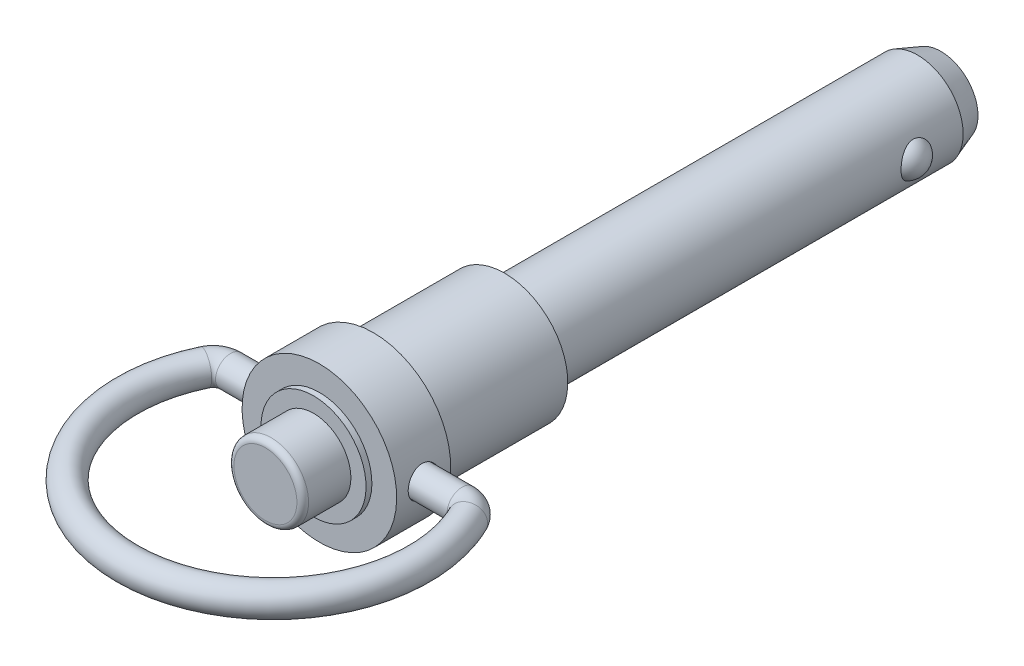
ISO-10303-21;
HEADER;
FILE_DESCRIPTION(('STEP AP214'),'2;1');
FILE_NAME('part.step','',(''),(''),'','','');
FILE_SCHEMA(('AUTOMOTIVE_DESIGN { 1 0 10303 214 1 1 1 1 }'));
ENDSEC;
DATA;
#1=APPLICATION_CONTEXT('core data for automotive mechanical design processes');
#2=APPLICATION_PROTOCOL_DEFINITION('international standard','automotive_design',2000,#1);
#3=PRODUCT_CONTEXT('',#1,'mechanical');
#4=PRODUCT('Part','Part','',(#3));
#5=PRODUCT_RELATED_PRODUCT_CATEGORY('part','',(#4));
#6=PRODUCT_DEFINITION_FORMATION('','',#4);
#7=PRODUCT_DEFINITION_CONTEXT('part definition',#1,'design');
#8=PRODUCT_DEFINITION('design','',#6,#7);
#9=PRODUCT_DEFINITION_SHAPE('','',#8);
#10=(LENGTH_UNIT() NAMED_UNIT(*) SI_UNIT(.MILLI.,.METRE.));
#11=(NAMED_UNIT(*) PLANE_ANGLE_UNIT() SI_UNIT($,.RADIAN.));
#12=(NAMED_UNIT(*) SI_UNIT($,.STERADIAN.) SOLID_ANGLE_UNIT());
#13=UNCERTAINTY_MEASURE_WITH_UNIT(LENGTH_MEASURE(1.E-05),#10,'distance_accuracy_value','');
#14=(GEOMETRIC_REPRESENTATION_CONTEXT(3) GLOBAL_UNCERTAINTY_ASSIGNED_CONTEXT((#13)) GLOBAL_UNIT_ASSIGNED_CONTEXT((#10,
#11,#12)) REPRESENTATION_CONTEXT('',''));
#15=CARTESIAN_POINT('',(0.,0.,0.));
#16=DIRECTION('',(0.,0.,1.));
#17=DIRECTION('',(1.,0.,0.));
#18=AXIS2_PLACEMENT_3D('',#15,#16,#17);
#19=CARTESIAN_POINT('',(5.7785,0.,11.43));
#20=DIRECTION('',(0.,0.,-1.));
#21=DIRECTION('',(0.,1.,0.));
#22=AXIS2_PLACEMENT_3D('',#19,#20,#21);
#23=PLANE('',#22);
#24=CARTESIAN_POINT('',(0.,0.,11.43));
#25=DIRECTION('',(0.,0.,-1.));
#26=DIRECTION('',(0.,1.,0.));
#27=AXIS2_PLACEMENT_3D('',#24,#25,#26);
#28=CIRCLE('',#27,5.9);
#29=CARTESIAN_POINT('',(0.,5.9,11.43));
#30=VERTEX_POINT('',#29);
#31=EDGE_CURVE('E22',#30,#30,#28,.F.);
#32=ORIENTED_EDGE('',*,*,#31,.T.);
#33=EDGE_LOOP('',(#32));
#34=FACE_BOUND('',#33,.T.);
#35=CARTESIAN_POINT('',(0.,0.,11.43));
#36=DIRECTION('',(0.,0.,-1.));
#37=DIRECTION('',(0.,1.,0.));
#38=AXIS2_PLACEMENT_3D('',#35,#36,#37);
#39=CIRCLE('',#38,6.731);
#40=CARTESIAN_POINT('',(0.,6.731,11.43));
#41=VERTEX_POINT('',#40);
#42=EDGE_CURVE('E119',#41,#41,#39,.T.);
#43=ORIENTED_EDGE('',*,*,#42,.T.);
#44=EDGE_LOOP('',(#43));
#45=FACE_BOUND('',#44,.T.);
#46=ADVANCED_FACE('F14',(#34,#45),#23,.T.);
#47=CARTESIAN_POINT('',(0.,0.,20.828));
#48=DIRECTION('',(0.,0.,1.));
#49=DIRECTION('',(0.,-1.,0.));
#50=AXIS2_PLACEMENT_3D('',#47,#48,#49);
#51=PLANE('',#50);
#52=CARTESIAN_POINT('',(0.,0.,20.828));
#53=DIRECTION('',(0.,0.,-1.));
#54=DIRECTION('',(0.,1.,0.));
#55=AXIS2_PLACEMENT_3D('',#52,#53,#54);
#56=CIRCLE('',#55,2.7432);
#57=CARTESIAN_POINT('',(0.,2.7432,20.828));
#58=VERTEX_POINT('',#57);
#59=CARTESIAN_POINT('',(0.,-2.7432,20.828));
#60=VERTEX_POINT('',#59);
#61=EDGE_CURVE('E35',#58,#60,#56,.T.);
#62=ORIENTED_EDGE('',*,*,#61,.F.);
#63=CARTESIAN_POINT('',(0.,0.,20.828));
#64=DIRECTION('',(0.,0.,-1.));
#65=DIRECTION('',(0.,-1.,0.));
#66=AXIS2_PLACEMENT_3D('',#63,#64,#65);
#67=CIRCLE('',#66,2.7432);
#68=EDGE_CURVE('E28',#60,#58,#67,.T.);
#69=ORIENTED_EDGE('',*,*,#68,.F.);
#70=EDGE_LOOP('',(#62,#69));
#71=FACE_BOUND('',#70,.T.);
#72=ADVANCED_FACE('F41',(#71),#51,.T.);
#73=CARTESIAN_POINT('',(0.,0.,20.1422));
#74=DIRECTION('',(0.,1.,0.));
#75=DIRECTION('',(-1.,0.,0.));
#76=AXIS2_PLACEMENT_3D('',#73,#74,#75);
#77=TOROIDAL_SURFACE('',#76,12.7,1.2954);
#78=CARTESIAN_POINT('',(-11.4549005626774,0.,14.6581090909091));
#79=DIRECTION('',(-0.43181818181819,0.,0.901960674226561));
#80=DIRECTION('',(-0.901960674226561,0.,-0.43181818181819));
#81=AXIS2_PLACEMENT_3D('',#78,#79,#80);
#82=CIRCLE('',#81,1.2954);
#83=CARTESIAN_POINT('',(-12.6233004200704,0.,14.0987318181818));
#84=VERTEX_POINT('',#83);
#85=EDGE_CURVE('E108',#84,#84,#82,.F.);
#86=ORIENTED_EDGE('',*,*,#85,.F.);
#87=EDGE_LOOP('',(#86));
#88=FACE_BOUND('',#87,.T.);
#89=CARTESIAN_POINT('',(11.4549005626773,0.,14.658109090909));
#90=DIRECTION('',(-0.431818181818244,0.,-0.901960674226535));
#91=DIRECTION('',(0.901960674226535,0.,-0.431818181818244));
#92=AXIS2_PLACEMENT_3D('',#89,#90,#91);
#93=CIRCLE('',#92,1.2954);
#94=CARTESIAN_POINT('',(12.6233004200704,0.,14.0987318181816));
#95=VERTEX_POINT('',#94);
#96=EDGE_CURVE('E42',#95,#95,#93,.T.);
#97=ORIENTED_EDGE('',*,*,#96,.F.);
#98=EDGE_LOOP('',(#97));
#99=FACE_BOUND('',#98,.T.);
#100=ADVANCED_FACE('F60',(#88,#99),#77,.T.);
#101=CARTESIAN_POINT('',(0.,0.,20.32));
#102=DIRECTION('',(0.,0.,1.));
#103=DIRECTION('',(0.,-1.,0.));
#104=AXIS2_PLACEMENT_3D('',#101,#102,#103);
#105=TOROIDAL_SURFACE('',#104,2.7432,0.508);
#106=ORIENTED_EDGE('',*,*,#68,.T.);
#107=ORIENTED_EDGE('',*,*,#61,.T.);
#108=EDGE_LOOP('',(#106,#107));
#109=FACE_BOUND('',#108,.T.);
#110=CARTESIAN_POINT('',(0.,0.,20.32));
#111=DIRECTION('',(0.,0.,-1.));
#112=DIRECTION('',(0.,1.,0.));
#113=AXIS2_PLACEMENT_3D('',#110,#111,#112);
#114=CIRCLE('',#113,3.2512);
#115=CARTESIAN_POINT('',(0.,3.2512,20.32));
#116=VERTEX_POINT('',#115);
#117=EDGE_CURVE('E111',#116,#116,#114,.T.);
#118=ORIENTED_EDGE('',*,*,#117,.F.);
#119=EDGE_LOOP('',(#118));
#120=FACE_BOUND('',#119,.T.);
#121=ADVANCED_FACE('F33',(#109,#120),#105,.T.);
#122=CARTESIAN_POINT('',(10.0803124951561,0.,15.3162));
#123=DIRECTION('',(0.,1.,0.));
#124=DIRECTION('',(-1.,0.,0.));
#125=AXIS2_PLACEMENT_3D('',#122,#123,#124);
#126=TOROIDAL_SURFACE('',#125,1.524,1.2954);
#127=ORIENTED_EDGE('',*,*,#96,.T.);
#128=EDGE_LOOP('',(#127));
#129=FACE_BOUND('',#128,.T.);
#130=CARTESIAN_POINT('',(10.0803124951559,0.,13.7922));
#131=DIRECTION('',(1.,0.,0.));
#132=DIRECTION('',(0.,1.,0.));
#133=AXIS2_PLACEMENT_3D('',#130,#131,#132);
#134=CIRCLE('',#133,1.2954);
#135=CARTESIAN_POINT('',(10.0803124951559,1.2954,13.7922));
#136=VERTEX_POINT('',#135);
#137=EDGE_CURVE('E105',#136,#136,#134,.F.);
#138=ORIENTED_EDGE('',*,*,#137,.F.);
#139=EDGE_LOOP('',(#138));
#140=FACE_BOUND('',#139,.T.);
#141=ADVANCED_FACE('F84',(#129,#140),#126,.T.);
#142=CARTESIAN_POINT('',(-10.0803124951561,0.,15.3162));
#143=DIRECTION('',(0.,1.,0.));
#144=DIRECTION('',(-1.,0.,0.));
#145=AXIS2_PLACEMENT_3D('',#142,#143,#144);
#146=TOROIDAL_SURFACE('',#145,1.524,1.2954);
#147=CARTESIAN_POINT('',(-10.0803124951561,0.,13.7922));
#148=DIRECTION('',(1.,0.,0.));
#149=DIRECTION('',(0.,1.,0.));
#150=AXIS2_PLACEMENT_3D('',#147,#148,#149);
#151=CIRCLE('',#150,1.2954);
#152=CARTESIAN_POINT('',(-10.0803124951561,1.2954,13.7922));
#153=VERTEX_POINT('',#152);
#154=EDGE_CURVE('E100',#153,#153,#151,.T.);
#155=ORIENTED_EDGE('',*,*,#154,.F.);
#156=EDGE_LOOP('',(#155));
#157=FACE_BOUND('',#156,.T.);
#158=ORIENTED_EDGE('',*,*,#85,.T.);
#159=EDGE_LOOP('',(#158));
#160=FACE_BOUND('',#159,.T.);
#161=ADVANCED_FACE('F87',(#157,#160),#146,.T.);
#162=CARTESIAN_POINT('',(0.,0.,20.828));
#163=DIRECTION('',(0.,0.,-1.));
#164=DIRECTION('',(0.,1.,0.));
#165=AXIS2_PLACEMENT_3D('',#162,#163,#164);
#166=CYLINDRICAL_SURFACE('',#165,3.2512);
#167=CARTESIAN_POINT('',(0.,0.,16.637));
#168=DIRECTION('',(0.,0.,-1.));
#169=DIRECTION('',(0.,1.,0.));
#170=AXIS2_PLACEMENT_3D('',#167,#168,#169);
#171=CIRCLE('',#170,3.2512);
#172=CARTESIAN_POINT('',(0.,3.2512,16.637));
#173=VERTEX_POINT('',#172);
#174=EDGE_CURVE('E104',#173,#173,#171,.T.);
#175=ORIENTED_EDGE('',*,*,#174,.F.);
#176=EDGE_LOOP('',(#175));
#177=FACE_BOUND('',#176,.T.);
#178=ORIENTED_EDGE('',*,*,#117,.T.);
#179=EDGE_LOOP('',(#178));
#180=FACE_BOUND('',#179,.T.);
#181=ADVANCED_FACE('F89',(#177,#180),#166,.T.);
#182=CARTESIAN_POINT('',(-10.0803124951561,0.,13.7922));
#183=DIRECTION('',(1.,0.,0.));
#184=DIRECTION('',(0.,1.,0.));
#185=AXIS2_PLACEMENT_3D('',#182,#183,#184);
#186=CYLINDRICAL_SURFACE('',#185,1.2954);
#187=CARTESIAN_POINT('',(4.953,0.,13.7922));
#188=DIRECTION('',(1.,0.,0.));
#189=DIRECTION('',(0.,1.,0.));
#190=AXIS2_PLACEMENT_3D('',#187,#188,#189);
#191=CIRCLE('',#190,1.2954);
#192=CARTESIAN_POINT('',(4.953,1.2954,13.7922));
#193=VERTEX_POINT('',#192);
#194=EDGE_CURVE('E103',#193,#193,#191,.F.);
#195=ORIENTED_EDGE('',*,*,#194,.F.);
#196=EDGE_LOOP('',(#195));
#197=FACE_BOUND('',#196,.T.);
#198=ORIENTED_EDGE('',*,*,#137,.T.);
#199=EDGE_LOOP('',(#198));
#200=FACE_BOUND('',#199,.T.);
#201=ADVANCED_FACE('F92',(#197,#200),#186,.T.);
#202=CARTESIAN_POINT('',(-10.0803124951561,0.,13.7922));
#203=DIRECTION('',(1.,0.,0.));
#204=DIRECTION('',(0.,1.,0.));
#205=AXIS2_PLACEMENT_3D('',#202,#203,#204);
#206=CYLINDRICAL_SURFACE('',#205,1.2954);
#207=CARTESIAN_POINT('',(-4.953,0.,13.7922));
#208=DIRECTION('',(1.,0.,0.));
#209=DIRECTION('',(0.,1.,0.));
#210=AXIS2_PLACEMENT_3D('',#207,#208,#209);
#211=CIRCLE('',#210,1.2954);
#212=CARTESIAN_POINT('',(-4.953,1.2954,13.7922));
#213=VERTEX_POINT('',#212);
#214=EDGE_CURVE('E192',#213,#213,#211,.T.);
#215=ORIENTED_EDGE('',*,*,#214,.F.);
#216=EDGE_LOOP('',(#215));
#217=FACE_BOUND('',#216,.T.);
#218=ORIENTED_EDGE('',*,*,#154,.T.);
#219=EDGE_LOOP('',(#218));
#220=FACE_BOUND('',#219,.T.);
#221=ADVANCED_FACE('F238',(#217,#220),#206,.T.);
#222=CARTESIAN_POINT('',(4.572,0.,16.637));
#223=DIRECTION('',(0.,0.,1.));
#224=DIRECTION('',(0.,-1.,0.));
#225=AXIS2_PLACEMENT_3D('',#222,#223,#224);
#226=PLANE('',#225);
#227=ORIENTED_EDGE('',*,*,#174,.T.);
#228=EDGE_LOOP('',(#227));
#229=FACE_BOUND('',#228,.T.);
#230=CARTESIAN_POINT('',(0.,0.,16.637));
#231=DIRECTION('',(0.,0.,-1.));
#232=DIRECTION('',(0.,1.,0.));
#233=AXIS2_PLACEMENT_3D('',#230,#231,#232);
#234=CIRCLE('',#233,4.572);
#235=CARTESIAN_POINT('',(0.,4.572,16.637));
#236=VERTEX_POINT('',#235);
#237=EDGE_CURVE('E196',#236,#236,#234,.T.);
#238=ORIENTED_EDGE('',*,*,#237,.F.);
#239=EDGE_LOOP('',(#238));
#240=FACE_BOUND('',#239,.T.);
#241=ADVANCED_FACE('F205',(#229,#240),#226,.T.);
#242=CARTESIAN_POINT('',(4.953,0.,13.7922));
#243=DIRECTION('',(1.,0.,0.));
#244=DIRECTION('',(0.,1.,0.));
#245=AXIS2_PLACEMENT_3D('',#242,#243,#244);
#246=PLANE('',#245);
#247=CARTESIAN_POINT('',(4.953,0.,13.7922));
#248=DIRECTION('',(1.,0.,0.));
#249=DIRECTION('',(0.,1.,0.));
#250=AXIS2_PLACEMENT_3D('',#247,#248,#249);
#251=CIRCLE('',#250,1.3335);
#252=CARTESIAN_POINT('',(4.953,1.3335,13.7922));
#253=VERTEX_POINT('',#252);
#254=EDGE_CURVE('E189',#253,#253,#251,.T.);
#255=ORIENTED_EDGE('',*,*,#254,.T.);
#256=EDGE_LOOP('',(#255));
#257=FACE_BOUND('',#256,.T.);
#258=ORIENTED_EDGE('',*,*,#194,.T.);
#259=EDGE_LOOP('',(#258));
#260=FACE_BOUND('',#259,.T.);
#261=ADVANCED_FACE('F248',(#257,#260),#246,.T.);
#262=CARTESIAN_POINT('',(-4.953,0.,13.7922));
#263=DIRECTION('',(-1.,0.,0.));
#264=DIRECTION('',(0.,-1.,0.));
#265=AXIS2_PLACEMENT_3D('',#262,#263,#264);
#266=PLANE('',#265);
#267=CARTESIAN_POINT('',(-4.953,0.,13.7922));
#268=DIRECTION('',(-1.,0.,0.));
#269=DIRECTION('',(0.,-1.,0.));
#270=AXIS2_PLACEMENT_3D('',#267,#268,#269);
#271=CIRCLE('',#270,1.3335);
#272=CARTESIAN_POINT('',(-4.95299999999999,-1.33350000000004,13.7922));
#273=VERTEX_POINT('',#272);
#274=EDGE_CURVE('E156',#273,#273,#271,.T.);
#275=ORIENTED_EDGE('',*,*,#274,.T.);
#276=EDGE_LOOP('',(#275));
#277=FACE_BOUND('',#276,.T.);
#278=ORIENTED_EDGE('',*,*,#214,.T.);
#279=EDGE_LOOP('',(#278));
#280=FACE_BOUND('',#279,.T.);
#281=ADVANCED_FACE('F164',(#277,#280),#266,.T.);
#282=CARTESIAN_POINT('',(0.,0.,0.));
#283=DIRECTION('',(0.,0.,-1.));
#284=DIRECTION('',(0.,1.,0.));
#285=AXIS2_PLACEMENT_3D('',#282,#283,#284);
#286=CYLINDRICAL_SURFACE('',#285,4.572);
#287=ORIENTED_EDGE('',*,*,#237,.T.);
#288=EDGE_LOOP('',(#287));
#289=FACE_BOUND('',#288,.T.);
#290=CARTESIAN_POINT('',(0.,0.,16.129));
#291=DIRECTION('',(0.,0.,-1.));
#292=DIRECTION('',(0.,1.,0.));
#293=AXIS2_PLACEMENT_3D('',#290,#291,#292);
#294=CIRCLE('',#293,4.572);
#295=CARTESIAN_POINT('',(0.,4.572,16.129));
#296=VERTEX_POINT('',#295);
#297=EDGE_CURVE('E191',#296,#296,#294,.T.);
#298=ORIENTED_EDGE('',*,*,#297,.F.);
#299=EDGE_LOOP('',(#298));
#300=FACE_BOUND('',#299,.T.);
#301=ADVANCED_FACE('F162',(#289,#300),#286,.T.);
#302=CARTESIAN_POINT('',(4.953,0.,13.7922));
#303=DIRECTION('',(1.,0.,0.));
#304=DIRECTION('',(0.,1.,0.));
#305=AXIS2_PLACEMENT_3D('',#302,#303,#304);
#306=CYLINDRICAL_SURFACE('',#305,1.3335);
#307=CARTESIAN_POINT('',(6.59758582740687,1.3335,13.7922));
#308=CARTESIAN_POINT('',(6.59758765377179,1.333496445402,13.718166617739));
#309=CARTESIAN_POINT('',(6.59884669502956,1.3273080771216,13.6440410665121));
#310=CARTESIAN_POINT('',(6.60374356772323,1.30272126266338,13.4978267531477));
#311=CARTESIAN_POINT('',(6.60738612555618,1.28429855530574,13.4257423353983));
#312=CARTESIAN_POINT('',(6.61662138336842,1.23583426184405,13.28583488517));
#313=CARTESIAN_POINT('',(6.622211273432,1.20580941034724,13.2180058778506));
#314=CARTESIAN_POINT('',(6.63470762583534,1.13503345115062,13.0883707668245));
#315=CARTESIAN_POINT('',(6.64161365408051,1.09428587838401,13.0265626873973));
#316=CARTESIAN_POINT('',(6.6560731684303,1.00260929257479,12.9098323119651));
#317=CARTESIAN_POINT('',(6.66363369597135,0.951558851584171,12.8550062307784));
#318=CARTESIAN_POINT('',(6.6784886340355,0.840985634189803,12.7546347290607));
#319=CARTESIAN_POINT('',(6.68578301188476,0.781461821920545,12.7090904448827));
#320=CARTESIAN_POINT('',(6.69935837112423,0.655004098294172,12.6282103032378));
#321=CARTESIAN_POINT('',(6.70563018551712,0.588011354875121,12.5929647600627));
#322=CARTESIAN_POINT('',(6.7163755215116,0.448910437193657,12.5342656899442));
#323=CARTESIAN_POINT('',(6.72084922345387,0.376802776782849,12.5108109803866));
#324=CARTESIAN_POINT('',(6.72744504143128,0.230507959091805,12.4766555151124));
#325=CARTESIAN_POINT('',(6.72959681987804,0.156359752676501,12.4657937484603));
#326=CARTESIAN_POINT('',(6.73140875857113,0.00726425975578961,12.4566302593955));
#327=CARTESIAN_POINT('',(6.73106915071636,-0.0676829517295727,12.4583273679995));
#328=CARTESIAN_POINT('',(6.72795960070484,-0.215142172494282,12.4741110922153));
#329=CARTESIAN_POINT('',(6.72522369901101,-0.287673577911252,12.4880241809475));
#330=CARTESIAN_POINT('',(6.71766729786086,-0.429351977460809,12.5275699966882));
#331=CARTESIAN_POINT('',(6.71284670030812,-0.498498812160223,12.5532032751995));
#332=CARTESIAN_POINT('',(6.701606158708,-0.631943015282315,12.6156242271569));
#333=CARTESIAN_POINT('',(6.69517643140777,-0.696207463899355,12.6524804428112));
#334=CARTESIAN_POINT('',(6.68142742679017,-0.817699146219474,12.7362475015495));
#335=CARTESIAN_POINT('',(6.67410811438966,-0.874926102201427,12.7831587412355));
#336=CARTESIAN_POINT('',(6.65924190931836,-0.981743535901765,12.8866477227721));
#337=CARTESIAN_POINT('',(6.65169326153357,-1.03118836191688,12.9433756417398));
#338=CARTESIAN_POINT('',(6.63733339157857,-1.11990778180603,13.06442219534));
#339=CARTESIAN_POINT('',(6.63052249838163,-1.1591778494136,13.1287441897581));
#340=CARTESIAN_POINT('',(6.61840508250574,-1.22647971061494,13.2633777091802));
#341=CARTESIAN_POINT('',(6.61310290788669,-1.25447911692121,13.3337058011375));
#342=CARTESIAN_POINT('',(6.60466715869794,-1.29816626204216,13.4781072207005));
#343=CARTESIAN_POINT('',(6.6015290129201,-1.31387996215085,13.5521722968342));
#344=CARTESIAN_POINT('',(6.59896792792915,-1.32664627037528,13.6543666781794));
#345=CARTESIAN_POINT('',(6.59845085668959,-1.3292142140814,13.6818643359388));
#346=CARTESIAN_POINT('',(6.59775946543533,-1.33264174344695,13.7369703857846));
#347=CARTESIAN_POINT('',(6.59758514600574,-1.33350132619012,13.7645787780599));
#348=CARTESIAN_POINT('',(6.59758765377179,-1.333496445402,13.866233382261));
#349=CARTESIAN_POINT('',(6.59884669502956,-1.3273080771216,13.9403589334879));
#350=CARTESIAN_POINT('',(6.60374356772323,-1.30272126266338,14.0865732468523));
#351=CARTESIAN_POINT('',(6.60738612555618,-1.28429855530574,14.1586576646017));
#352=CARTESIAN_POINT('',(6.61662138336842,-1.23583426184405,14.29856511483));
#353=CARTESIAN_POINT('',(6.622211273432,-1.20580941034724,14.3663941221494));
#354=CARTESIAN_POINT('',(6.63470762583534,-1.13503345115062,14.4960292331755));
#355=CARTESIAN_POINT('',(6.64161365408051,-1.09428587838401,14.5578373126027));
#356=CARTESIAN_POINT('',(6.6560731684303,-1.00260929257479,14.6745676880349));
#357=CARTESIAN_POINT('',(6.66363369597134,-0.951558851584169,14.7293937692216));
#358=CARTESIAN_POINT('',(6.6784886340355,-0.840985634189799,14.8297652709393));
#359=CARTESIAN_POINT('',(6.68578301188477,-0.781461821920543,14.8753095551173));
#360=CARTESIAN_POINT('',(6.69935837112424,-0.65500409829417,14.9561896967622));
#361=CARTESIAN_POINT('',(6.70563018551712,-0.588011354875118,14.9914352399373));
#362=CARTESIAN_POINT('',(6.7163755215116,-0.448910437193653,15.0501343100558));
#363=CARTESIAN_POINT('',(6.72084922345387,-0.376802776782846,15.0735890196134));
#364=CARTESIAN_POINT('',(6.72744504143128,-0.230507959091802,15.1077444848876));
#365=CARTESIAN_POINT('',(6.72959681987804,-0.156359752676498,15.1186062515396));
#366=CARTESIAN_POINT('',(6.73140875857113,-0.00726425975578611,15.1277697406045));
#367=CARTESIAN_POINT('',(6.73106915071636,0.0676829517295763,15.1260726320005));
#368=CARTESIAN_POINT('',(6.72795960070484,0.215142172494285,15.1102889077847));
#369=CARTESIAN_POINT('',(6.72522369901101,0.287673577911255,15.0963758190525));
#370=CARTESIAN_POINT('',(6.71766729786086,0.429351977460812,15.0568300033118));
#371=CARTESIAN_POINT('',(6.71284670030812,0.498498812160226,15.0311967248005));
#372=CARTESIAN_POINT('',(6.701606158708,0.631943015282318,14.9687757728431));
#373=CARTESIAN_POINT('',(6.69517643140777,0.696207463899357,14.9319195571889));
#374=CARTESIAN_POINT('',(6.68142742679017,0.817699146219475,14.8481524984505));
#375=CARTESIAN_POINT('',(6.67410811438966,0.874926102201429,14.8012412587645));
#376=CARTESIAN_POINT('',(6.65924190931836,0.981743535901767,14.6977522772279));
#377=CARTESIAN_POINT('',(6.65169326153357,1.03118836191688,14.6410243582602));
#378=CARTESIAN_POINT('',(6.63733339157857,1.11990778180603,14.51997780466));
#379=CARTESIAN_POINT('',(6.63052249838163,1.1591778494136,14.4556558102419));
#380=CARTESIAN_POINT('',(6.61840508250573,1.22647971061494,14.3210222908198));
#381=CARTESIAN_POINT('',(6.61310290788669,1.25447911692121,14.2506941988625));
#382=CARTESIAN_POINT('',(6.60466715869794,1.29816626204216,14.1062927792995));
#383=CARTESIAN_POINT('',(6.6015290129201,1.31387996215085,14.0322277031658));
#384=CARTESIAN_POINT('',(6.59896792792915,1.32664627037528,13.9300333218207));
#385=CARTESIAN_POINT('',(6.59845085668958,1.3292142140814,13.9025356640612));
#386=CARTESIAN_POINT('',(6.59775946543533,1.33264174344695,13.8474296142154));
#387=CARTESIAN_POINT('',(6.59758514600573,1.33350132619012,13.8198212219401));
#388=CARTESIAN_POINT('',(6.59758582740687,1.3335,13.7922));
#389=B_SPLINE_CURVE_WITH_KNOTS('',3,(#307,#308,#309,#310,#311,#312,#313,#314,#315,#316,#317,
#318,#319,#320,#321,#322,#323,#324,#325,#326,#327,#328,#329,#330,#331,#332,#333,#334,#335,#336,
#337,#338,#339,#340,#341,#342,#343,#344,#345,#346,#347,#348,#349,#350,#351,#352,#353,#354,#355,
#356,#357,#358,#359,#360,#361,#362,#363,#364,#365,#366,#367,#368,#369,#370,#371,#372,#373,#374,
#375,#376,#377,#378,#379,#380,#381,#382,#383,#384,#385,#386,#387,#388),.UNSPECIFIED.,.T.,.F.,(4,
2,2,2,2,2,2,2,2,2,2,2,2,2,2,2,2,2,2,2,2,2,2,2,2,2,2,2,2,2,2,2,2,2,2,2,2,2,2,2,4),(0.,
0.221994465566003,0.444430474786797,0.666546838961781,0.888590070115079,1.11342160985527,
1.33828065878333,1.56505617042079,1.79180893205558,2.01562934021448,2.23942891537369,
2.46009995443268,2.68078137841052,2.90283856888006,3.12490451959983,3.35072919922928,
3.5766541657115,3.80322379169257,4.02931334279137,4.11213743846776,4.19496167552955,
4.41695614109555,4.63939215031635,4.86150851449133,5.08355174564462,5.30838328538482,
5.53324233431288,5.76001784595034,5.98677060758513,6.21059101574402,6.43439059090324,
6.65506162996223,6.87574305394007,7.09780024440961,7.31986619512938,7.54569087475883,
7.77161584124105,7.99818546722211,8.22427501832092,8.30709911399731,8.38992335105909),.UNSPECIFIED.);
#390=CARTESIAN_POINT('',(6.59758582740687,1.3335,13.7922));
#391=VERTEX_POINT('',#390);
#392=EDGE_CURVE('E149',#391,#391,#389,.T.);
#393=ORIENTED_EDGE('',*,*,#392,.F.);
#394=EDGE_LOOP('',(#393));
#395=FACE_BOUND('',#394,.T.);
#396=ORIENTED_EDGE('',*,*,#254,.F.);
#397=EDGE_LOOP('',(#396));
#398=FACE_BOUND('',#397,.T.);
#399=ADVANCED_FACE('F158',(#395,#398),#306,.F.);
#400=CARTESIAN_POINT('',(-4.953,0.,13.7922));
#401=DIRECTION('',(-1.,0.,0.));
#402=DIRECTION('',(0.,-1.,0.));
#403=AXIS2_PLACEMENT_3D('',#400,#401,#402);
#404=CYLINDRICAL_SURFACE('',#403,1.3335);
#405=CARTESIAN_POINT('',(-6.59758582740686,-1.33350000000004,13.7922));
#406=CARTESIAN_POINT('',(-6.59758765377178,-1.33349644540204,13.718166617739));
#407=CARTESIAN_POINT('',(-6.59884669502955,-1.32730807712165,13.6440410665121));
#408=CARTESIAN_POINT('',(-6.60374356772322,-1.30272126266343,13.4978267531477));
#409=CARTESIAN_POINT('',(-6.60738612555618,-1.28429855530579,13.4257423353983));
#410=CARTESIAN_POINT('',(-6.61662138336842,-1.2358342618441,13.28583488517));
#411=CARTESIAN_POINT('',(-6.62221127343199,-1.20580941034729,13.2180058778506));
#412=CARTESIAN_POINT('',(-6.63470762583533,-1.13503345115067,13.0883707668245));
#413=CARTESIAN_POINT('',(-6.64161365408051,-1.09428587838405,13.0265626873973));
#414=CARTESIAN_POINT('',(-6.6560731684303,-1.00260929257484,12.9098323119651));
#415=CARTESIAN_POINT('',(-6.66363369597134,-0.951558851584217,12.8550062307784));
#416=CARTESIAN_POINT('',(-6.67848863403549,-0.840985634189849,12.7546347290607));
#417=CARTESIAN_POINT('',(-6.68578301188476,-0.781461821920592,12.7090904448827));
#418=CARTESIAN_POINT('',(-6.69935837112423,-0.655004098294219,12.6282103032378));
#419=CARTESIAN_POINT('',(-6.70563018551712,-0.588011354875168,12.5929647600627));
#420=CARTESIAN_POINT('',(-6.71637552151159,-0.448910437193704,12.5342656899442));
#421=CARTESIAN_POINT('',(-6.72084922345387,-0.376802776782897,12.5108109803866));
#422=CARTESIAN_POINT('',(-6.72744504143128,-0.230507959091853,12.4766555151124));
#423=CARTESIAN_POINT('',(-6.72959681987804,-0.156359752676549,12.4657937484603));
#424=CARTESIAN_POINT('',(-6.73140875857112,-0.007264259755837,12.4566302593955));
#425=CARTESIAN_POINT('',(-6.73106915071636,0.0676829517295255,12.4583273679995));
#426=CARTESIAN_POINT('',(-6.72795960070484,0.215142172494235,12.4741110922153));
#427=CARTESIAN_POINT('',(-6.72522369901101,0.287673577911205,12.4880241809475));
#428=CARTESIAN_POINT('',(-6.71766729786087,0.429351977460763,12.5275699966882));
#429=CARTESIAN_POINT('',(-6.71284670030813,0.498498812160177,12.5532032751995));
#430=CARTESIAN_POINT('',(-6.70160615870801,0.631943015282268,12.6156242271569));
#431=CARTESIAN_POINT('',(-6.69517643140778,0.696207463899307,12.6524804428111));
#432=CARTESIAN_POINT('',(-6.68142742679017,0.817699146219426,12.7362475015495));
#433=CARTESIAN_POINT('',(-6.67410811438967,0.87492610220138,12.7831587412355));
#434=CARTESIAN_POINT('',(-6.65924190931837,0.98174353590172,12.8866477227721));
#435=CARTESIAN_POINT('',(-6.65169326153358,1.03118836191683,12.9433756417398));
#436=CARTESIAN_POINT('',(-6.63733339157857,1.11990778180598,13.06442219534));
#437=CARTESIAN_POINT('',(-6.63052249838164,1.15917784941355,13.1287441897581));
#438=CARTESIAN_POINT('',(-6.61840508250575,1.22647971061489,13.2633777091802));
#439=CARTESIAN_POINT('',(-6.6131029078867,1.25447911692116,13.3337058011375));
#440=CARTESIAN_POINT('',(-6.60466715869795,1.29816626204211,13.4781072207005));
#441=CARTESIAN_POINT('',(-6.60152901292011,1.3138799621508,13.5521722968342));
#442=CARTESIAN_POINT('',(-6.59896792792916,1.32664627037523,13.6543666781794));
#443=CARTESIAN_POINT('',(-6.59845085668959,1.32921421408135,13.6818643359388));
#444=CARTESIAN_POINT('',(-6.59775946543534,1.33264174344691,13.7369703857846));
#445=CARTESIAN_POINT('',(-6.59758514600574,1.33350132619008,13.7645787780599));
#446=CARTESIAN_POINT('',(-6.5975876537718,1.33349644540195,13.866233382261));
#447=CARTESIAN_POINT('',(-6.59884669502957,1.32730807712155,13.9403589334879));
#448=CARTESIAN_POINT('',(-6.60374356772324,1.30272126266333,14.0865732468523));
#449=CARTESIAN_POINT('',(-6.60738612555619,1.28429855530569,14.1586576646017));
#450=CARTESIAN_POINT('',(-6.61662138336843,1.235834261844,14.29856511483));
#451=CARTESIAN_POINT('',(-6.62221127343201,1.20580941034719,14.3663941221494));
#452=CARTESIAN_POINT('',(-6.63470762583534,1.13503345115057,14.4960292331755));
#453=CARTESIAN_POINT('',(-6.64161365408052,1.09428587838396,14.5578373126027));
#454=CARTESIAN_POINT('',(-6.65607316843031,1.00260929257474,14.6745676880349));
#455=CARTESIAN_POINT('',(-6.66363369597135,0.95155885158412,14.7293937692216));
#456=CARTESIAN_POINT('',(-6.67848863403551,0.840985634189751,14.8297652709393));
#457=CARTESIAN_POINT('',(-6.68578301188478,0.781461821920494,14.8753095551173));
#458=CARTESIAN_POINT('',(-6.69935837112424,0.655004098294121,14.9561896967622));
#459=CARTESIAN_POINT('',(-6.70563018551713,0.58801135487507,14.9914352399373));
#460=CARTESIAN_POINT('',(-6.7163755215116,0.448910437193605,15.0501343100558));
#461=CARTESIAN_POINT('',(-6.72084922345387,0.376802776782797,15.0735890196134));
#462=CARTESIAN_POINT('',(-6.72744504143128,0.230507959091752,15.1077444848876));
#463=CARTESIAN_POINT('',(-6.72959681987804,0.156359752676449,15.1186062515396));
#464=CARTESIAN_POINT('',(-6.73140875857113,0.0072642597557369,15.1277697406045));
#465=CARTESIAN_POINT('',(-6.73106915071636,-0.0676829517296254,15.1260726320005));
#466=CARTESIAN_POINT('',(-6.72795960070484,-0.215142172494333,15.1102889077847));
#467=CARTESIAN_POINT('',(-6.725223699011,-0.287673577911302,15.0963758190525));
#468=CARTESIAN_POINT('',(-6.71766729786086,-0.42935197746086,15.0568300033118));
#469=CARTESIAN_POINT('',(-6.71284670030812,-0.498498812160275,15.0311967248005));
#470=CARTESIAN_POINT('',(-6.701606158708,-0.631943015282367,14.9687757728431));
#471=CARTESIAN_POINT('',(-6.69517643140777,-0.696207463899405,14.9319195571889));
#472=CARTESIAN_POINT('',(-6.68142742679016,-0.817699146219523,14.8481524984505));
#473=CARTESIAN_POINT('',(-6.67410811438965,-0.874926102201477,14.8012412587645));
#474=CARTESIAN_POINT('',(-6.65924190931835,-0.981743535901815,14.6977522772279));
#475=CARTESIAN_POINT('',(-6.65169326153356,-1.03118836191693,14.6410243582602));
#476=CARTESIAN_POINT('',(-6.63733339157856,-1.11990778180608,14.51997780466));
#477=CARTESIAN_POINT('',(-6.63052249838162,-1.15917784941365,14.4556558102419));
#478=CARTESIAN_POINT('',(-6.61840508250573,-1.22647971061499,14.3210222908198));
#479=CARTESIAN_POINT('',(-6.61310290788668,-1.25447911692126,14.2506941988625));
#480=CARTESIAN_POINT('',(-6.60466715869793,-1.2981662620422,14.1062927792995));
#481=CARTESIAN_POINT('',(-6.60152901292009,-1.31387996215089,14.0322277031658));
#482=CARTESIAN_POINT('',(-6.59896792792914,-1.32664627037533,13.9300333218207));
#483=CARTESIAN_POINT('',(-6.59845085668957,-1.32921421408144,13.9025356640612));
#484=CARTESIAN_POINT('',(-6.59775946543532,-1.332641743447,13.8474296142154));
#485=CARTESIAN_POINT('',(-6.59758514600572,-1.33350132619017,13.8198212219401));
#486=CARTESIAN_POINT('',(-6.59758582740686,-1.33350000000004,13.7922));
#487=B_SPLINE_CURVE_WITH_KNOTS('',3,(#405,#406,#407,#408,#409,#410,#411,#412,#413,#414,#415,
#416,#417,#418,#419,#420,#421,#422,#423,#424,#425,#426,#427,#428,#429,#430,#431,#432,#433,#434,
#435,#436,#437,#438,#439,#440,#441,#442,#443,#444,#445,#446,#447,#448,#449,#450,#451,#452,#453,
#454,#455,#456,#457,#458,#459,#460,#461,#462,#463,#464,#465,#466,#467,#468,#469,#470,#471,#472,
#473,#474,#475,#476,#477,#478,#479,#480,#481,#482,#483,#484,#485,#486),.UNSPECIFIED.,.T.,.F.,(4,
2,2,2,2,2,2,2,2,2,2,2,2,2,2,2,2,2,2,2,2,2,2,2,2,2,2,2,2,2,2,2,2,2,2,2,2,2,2,2,4),(0.,
0.221994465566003,0.444430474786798,0.666546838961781,0.888590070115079,1.11342160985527,
1.33828065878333,1.56505617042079,1.79180893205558,2.01562934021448,2.23942891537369,
2.46009995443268,2.68078137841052,2.90283856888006,3.12490451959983,3.35072919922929,
3.5766541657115,3.80322379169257,4.02931334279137,4.11213743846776,4.19496167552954,
4.41695614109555,4.63939215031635,4.86150851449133,5.08355174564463,5.30838328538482,
5.53324233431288,5.76001784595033,5.98677060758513,6.21059101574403,6.43439059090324,
6.65506162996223,6.87574305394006,7.09780024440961,7.31986619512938,7.54569087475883,
7.77161584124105,7.99818546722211,8.22427501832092,8.3070991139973,8.38992335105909),.UNSPECIFIED.);
#488=CARTESIAN_POINT('',(-6.59758582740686,-1.33350000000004,13.7922));
#489=VERTEX_POINT('',#488);
#490=EDGE_CURVE('E128',#489,#489,#487,.T.);
#491=ORIENTED_EDGE('',*,*,#490,.F.);
#492=EDGE_LOOP('',(#491));
#493=FACE_BOUND('',#492,.T.);
#494=ORIENTED_EDGE('',*,*,#274,.F.);
#495=EDGE_LOOP('',(#494));
#496=FACE_BOUND('',#495,.T.);
#497=ADVANCED_FACE('F138',(#493,#496),#404,.F.);
#498=CARTESIAN_POINT('',(6.731,0.,16.129));
#499=DIRECTION('',(0.,0.,1.));
#500=DIRECTION('',(0.,-1.,0.));
#501=AXIS2_PLACEMENT_3D('',#498,#499,#500);
#502=PLANE('',#501);
#503=CARTESIAN_POINT('',(0.,0.,16.129));
#504=DIRECTION('',(0.,0.,-1.));
#505=DIRECTION('',(0.,1.,0.));
#506=AXIS2_PLACEMENT_3D('',#503,#504,#505);
#507=CIRCLE('',#506,6.731);
#508=CARTESIAN_POINT('',(0.,6.731,16.129));
#509=VERTEX_POINT('',#508);
#510=EDGE_CURVE('E136',#509,#509,#507,.T.);
#511=ORIENTED_EDGE('',*,*,#510,.F.);
#512=EDGE_LOOP('',(#511));
#513=FACE_BOUND('',#512,.T.);
#514=ORIENTED_EDGE('',*,*,#297,.T.);
#515=EDGE_LOOP('',(#514));
#516=FACE_BOUND('',#515,.T.);
#517=ADVANCED_FACE('F145',(#513,#516),#502,.T.);
#518=CARTESIAN_POINT('',(0.,0.,0.));
#519=DIRECTION('',(0.,0.,-1.));
#520=DIRECTION('',(0.,1.,0.));
#521=AXIS2_PLACEMENT_3D('',#518,#519,#520);
#522=CYLINDRICAL_SURFACE('',#521,6.731);
#523=ORIENTED_EDGE('',*,*,#510,.T.);
#524=EDGE_LOOP('',(#523));
#525=FACE_BOUND('',#524,.T.);
#526=ORIENTED_EDGE('',*,*,#490,.T.);
#527=EDGE_LOOP('',(#526));
#528=FACE_BOUND('',#527,.T.);
#529=ORIENTED_EDGE('',*,*,#42,.F.);
#530=EDGE_LOOP('',(#529));
#531=FACE_BOUND('',#530,.T.);
#532=ORIENTED_EDGE('',*,*,#392,.T.);
#533=EDGE_LOOP('',(#532));
#534=FACE_BOUND('',#533,.T.);
#535=ADVANCED_FACE('F141',(#525,#528,#531,#534),#522,.T.);
#536=CARTESIAN_POINT('',(0.,0.,41.6574426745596));
#537=DIRECTION('',(0.,0.,-1.));
#538=DIRECTION('',(0.,1.,0.));
#539=AXIS2_PLACEMENT_3D('',#536,#537,#538);
#540=CYLINDRICAL_SURFACE('',#539,5.5);
#541=CARTESIAN_POINT('',(0.,0.,11.03));
#542=DIRECTION('',(0.,0.,-1.));
#543=DIRECTION('',(0.,1.,0.));
#544=AXIS2_PLACEMENT_3D('',#541,#542,#543);
#545=CIRCLE('',#544,5.5);
#546=CARTESIAN_POINT('',(0.,5.5,11.03));
#547=VERTEX_POINT('',#546);
#548=EDGE_CURVE('E9',#547,#547,#545,.T.);
#549=ORIENTED_EDGE('',*,*,#548,.T.);
#550=EDGE_LOOP('',(#549));
#551=FACE_BOUND('',#550,.T.);
#552=CARTESIAN_POINT('',(0.,0.,0.));
#553=DIRECTION('',(0.,0.,-1.));
#554=DIRECTION('',(0.,1.,0.));
#555=AXIS2_PLACEMENT_3D('',#552,#553,#554);
#556=CIRCLE('',#555,5.5);
#557=CARTESIAN_POINT('',(0.,5.5,0.));
#558=VERTEX_POINT('',#557);
#559=EDGE_CURVE('E395',#558,#558,#556,.T.);
#560=ORIENTED_EDGE('',*,*,#559,.F.);
#561=EDGE_LOOP('',(#560));
#562=FACE_BOUND('',#561,.T.);
#563=ADVANCED_FACE('F61',(#551,#562),#540,.T.);
#564=CARTESIAN_POINT('',(3.22979748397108,0.,-37.9908));
#565=DIRECTION('',(0.,0.,1.));
#566=DIRECTION('',(0.,-1.,0.));
#567=AXIS2_PLACEMENT_3D('',#564,#565,#566);
#568=PLANE('',#567);
#569=CARTESIAN_POINT('',(0.,0.,-37.9907999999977));
#570=DIRECTION('',(0.,0.,1.));
#571=DIRECTION('',(0.,-1.,0.));
#572=AXIS2_PLACEMENT_3D('',#569,#570,#571);
#573=CIRCLE('',#572,3.22979748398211);
#574=CARTESIAN_POINT('',(0.,-3.22979748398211,-37.9907999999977));
#575=VERTEX_POINT('',#574);
#576=EDGE_CURVE('E45',#575,#575,#573,.T.);
#577=ORIENTED_EDGE('',*,*,#576,.F.);
#578=EDGE_LOOP('',(#577));
#579=FACE_BOUND('',#578,.T.);
#580=ADVANCED_FACE('F309',(#579),#568,.F.);
#581=CARTESIAN_POINT('',(3.12293,0.,-31.8948));
#582=DIRECTION('',(0.,0.,1.));
#583=DIRECTION('',(1.,0.,0.));
#584=AXIS2_PLACEMENT_3D('',#581,#582,#583);
#585=SPHERICAL_SURFACE('',#584,1.5875);
#586=CARTESIAN_POINT('',(3.969385,0.,-30.5517921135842));
#587=CARTESIAN_POINT('',(3.96938133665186,0.0871787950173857,-30.5517940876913));
#588=CARTESIAN_POINT('',(3.96648576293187,0.174428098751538,-30.5584820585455));
#589=CARTESIAN_POINT('',(3.95516905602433,0.346584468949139,-30.5851998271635));
#590=CARTESIAN_POINT('',(3.94674017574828,0.431488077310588,-30.6052483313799));
#591=CARTESIAN_POINT('',(3.92519423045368,0.596479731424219,-30.6585272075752));
#592=CARTESIAN_POINT('',(3.91207555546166,0.676566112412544,-30.6917621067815));
#593=CARTESIAN_POINT('',(3.88253654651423,0.829452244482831,-30.7710588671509));
#594=CARTESIAN_POINT('',(3.86611699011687,0.902253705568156,-30.8171177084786));
#595=CARTESIAN_POINT('',(3.83222363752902,1.03672093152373,-30.9203356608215));
#596=CARTESIAN_POINT('',(3.81477966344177,1.0985904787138,-30.9772380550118));
#597=CARTESIAN_POINT('',(3.78068495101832,1.21073548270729,-31.1017462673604));
#598=CARTESIAN_POINT('',(3.76403384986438,1.26101628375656,-31.1693471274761));
#599=CARTESIAN_POINT('',(3.73507217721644,1.34426479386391,-31.3077911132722));
#600=CARTESIAN_POINT('',(3.72252093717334,1.37829571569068,-31.3779422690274));
#601=CARTESIAN_POINT('',(3.70178973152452,1.43305274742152,-31.5238520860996));
#602=CARTESIAN_POINT('',(3.69360549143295,1.45379187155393,-31.5996051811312));
#603=CARTESIAN_POINT('',(3.68341966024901,1.47939277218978,-31.7454817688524));
#604=CARTESIAN_POINT('',(3.680835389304,1.4857542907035,-31.8153038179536));
#605=CARTESIAN_POINT('',(3.68040725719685,1.48681628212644,-31.9550414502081));
#606=CARTESIAN_POINT('',(3.68256179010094,1.48152070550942,-32.0249569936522));
#607=CARTESIAN_POINT('',(3.69108766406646,1.46013938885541,-32.1588086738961));
#608=CARTESIAN_POINT('',(3.69721728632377,1.44467149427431,-32.2228608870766));
#609=CARTESIAN_POINT('',(3.71278611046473,1.40417367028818,-32.3474287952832));
#610=CARTESIAN_POINT('',(3.72222570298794,1.37914261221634,-32.4079440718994));
#611=CARTESIAN_POINT('',(3.74389633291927,1.3192072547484,-32.5264268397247));
#612=CARTESIAN_POINT('',(3.75622345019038,1.28394990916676,-32.5841973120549));
#613=CARTESIAN_POINT('',(3.78224213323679,1.20514746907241,-32.6934181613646));
#614=CARTESIAN_POINT('',(3.79593412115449,1.16159980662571,-32.7448665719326));
#615=CARTESIAN_POINT('',(3.82484228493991,1.06277839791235,-32.8454045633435));
#616=CARTESIAN_POINT('',(3.84007638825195,1.0067738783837,-32.893769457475));
#617=CARTESIAN_POINT('',(3.86933265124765,0.887713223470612,-32.9813922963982));
#618=CARTESIAN_POINT('',(3.88335410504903,0.824653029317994,-33.0206449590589));
#619=CARTESIAN_POINT('',(3.90318345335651,0.722863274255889,-33.0740110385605));
#620=CARTESIAN_POINT('',(3.90984058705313,0.686009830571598,-33.0914710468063));
#621=CARTESIAN_POINT('',(3.92226926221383,0.610957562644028,-33.123476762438));
#622=CARTESIAN_POINT('',(3.92804156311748,0.572759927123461,-33.1380249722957));
#623=CARTESIAN_POINT('',(3.94381689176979,0.456514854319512,-33.1772484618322));
#624=CARTESIAN_POINT('',(3.95229851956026,0.376714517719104,-33.197554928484));
#625=CARTESIAN_POINT('',(3.96199329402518,0.247044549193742,-33.2205332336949));
#626=CARTESIAN_POINT('',(3.96475587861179,0.197910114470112,-33.2270073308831));
#627=CARTESIAN_POINT('',(3.96845279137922,0.0991914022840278,-33.2356452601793));
#628=CARTESIAN_POINT('',(3.96938708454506,0.0496071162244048,-33.2378090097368));
#629=CARTESIAN_POINT('',(3.96938133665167,-0.0871787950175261,-33.2378059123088));
#630=CARTESIAN_POINT('',(3.96648576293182,-0.174428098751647,-33.2311179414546));
#631=CARTESIAN_POINT('',(3.95516905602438,-0.34658446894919,-33.2044001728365));
#632=CARTESIAN_POINT('',(3.94674017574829,-0.431488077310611,-33.18435166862));
#633=CARTESIAN_POINT('',(3.92519423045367,-0.596479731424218,-33.1310727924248));
#634=CARTESIAN_POINT('',(3.91207555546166,-0.676566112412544,-33.0978378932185));
#635=CARTESIAN_POINT('',(3.88253654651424,-0.829452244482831,-33.0185411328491));
#636=CARTESIAN_POINT('',(3.86611699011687,-0.902253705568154,-32.9724822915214));
#637=CARTESIAN_POINT('',(3.83222363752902,-1.03672093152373,-32.8692643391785));
#638=CARTESIAN_POINT('',(3.81477966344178,-1.0985904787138,-32.8123619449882));
#639=CARTESIAN_POINT('',(3.78068495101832,-1.21073548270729,-32.6878537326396));
#640=CARTESIAN_POINT('',(3.76403384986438,-1.26101628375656,-32.6202528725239));
#641=CARTESIAN_POINT('',(3.73507217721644,-1.34426479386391,-32.4818088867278));
#642=CARTESIAN_POINT('',(3.72252093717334,-1.37829571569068,-32.4116577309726));
#643=CARTESIAN_POINT('',(3.70178973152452,-1.43305274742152,-32.2657479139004));
#644=CARTESIAN_POINT('',(3.69360549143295,-1.45379187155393,-32.1899948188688));
#645=CARTESIAN_POINT('',(3.68341966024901,-1.47939277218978,-32.0441182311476));
#646=CARTESIAN_POINT('',(3.680835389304,-1.4857542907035,-31.9742961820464));
#647=CARTESIAN_POINT('',(3.68040725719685,-1.48681628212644,-31.8345585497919));
#648=CARTESIAN_POINT('',(3.68256179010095,-1.48152070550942,-31.7646430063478));
#649=CARTESIAN_POINT('',(3.69108766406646,-1.4601393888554,-31.6307913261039));
#650=CARTESIAN_POINT('',(3.69721728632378,-1.44467149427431,-31.5667391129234));
#651=CARTESIAN_POINT('',(3.71278611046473,-1.40417367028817,-31.4421712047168));
#652=CARTESIAN_POINT('',(3.72222570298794,-1.37914261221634,-31.3816559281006));
#653=CARTESIAN_POINT('',(3.74389633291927,-1.3192072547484,-31.2631731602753));
#654=CARTESIAN_POINT('',(3.75622345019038,-1.28394990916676,-31.2054026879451));
#655=CARTESIAN_POINT('',(3.78224213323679,-1.2051474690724,-31.0961818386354));
#656=CARTESIAN_POINT('',(3.79593412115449,-1.1615998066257,-31.0447334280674));
#657=CARTESIAN_POINT('',(3.82484228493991,-1.06277839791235,-30.9441954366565));
#658=CARTESIAN_POINT('',(3.84007638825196,-1.0067738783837,-30.895830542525));
#659=CARTESIAN_POINT('',(3.86933265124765,-0.887713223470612,-30.8082077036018));
#660=CARTESIAN_POINT('',(3.88335410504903,-0.824653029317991,-30.7689550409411));
#661=CARTESIAN_POINT('',(3.90318345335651,-0.722863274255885,-30.7155889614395));
#662=CARTESIAN_POINT('',(3.90984058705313,-0.686009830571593,-30.6981289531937));
#663=CARTESIAN_POINT('',(3.92226926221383,-0.610957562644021,-30.666123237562));
#664=CARTESIAN_POINT('',(3.92804156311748,-0.572759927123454,-30.6515750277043));
#665=CARTESIAN_POINT('',(3.94381689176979,-0.456514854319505,-30.6123515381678));
#666=CARTESIAN_POINT('',(3.95229851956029,-0.3767145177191,-30.592045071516));
#667=CARTESIAN_POINT('',(3.96199329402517,-0.247044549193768,-30.5690667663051));
#668=CARTESIAN_POINT('',(3.96475587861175,-0.197910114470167,-30.5625926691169));
#669=CARTESIAN_POINT('',(3.96845279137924,-0.0991914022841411,-30.5539547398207));
#670=CARTESIAN_POINT('',(3.96938708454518,-0.0496071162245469,-30.5517909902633));
#671=CARTESIAN_POINT('',(3.969385,0.,-30.5517921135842));
#672=B_SPLINE_CURVE_WITH_KNOTS('',3,(#586,#587,#588,#589,#590,#591,#592,#593,#594,#595,#596,
#597,#598,#599,#600,#601,#602,#603,#604,#605,#606,#607,#608,#609,#610,#611,#612,#613,#614,#615,
#616,#617,#618,#619,#620,#621,#622,#623,#624,#625,#626,#627,#628,#629,#630,#631,#632,#633,#634,
#635,#636,#637,#638,#639,#640,#641,#642,#643,#644,#645,#646,#647,#648,#649,#650,#651,#652,#653,
#654,#655,#656,#657,#658,#659,#660,#661,#662,#663,#664,#665,#666,#667,#668,#669,#670,#671),
.UNSPECIFIED.,.T.,.F.,(4,2,2,2,2,2,2,2,2,2,2,2,2,2,2,2,2,2,2,2,2,2,2,2,2,2,2,2,2,2,2,2,2,2,2,2,
2,2,2,2,2,2,4),(0.,0.261355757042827,0.523078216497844,0.784890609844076,1.04664140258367,
1.30282923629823,1.55889868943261,1.79448362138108,2.02983753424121,2.23921556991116,
2.44852266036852,2.64616391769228,2.84382850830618,3.04935366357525,3.25494258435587,
3.4806694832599,3.70652690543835,3.83036514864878,3.95409650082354,4.20121716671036,
4.34993288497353,4.49865145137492,4.76000720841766,5.02172966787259,5.28354206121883,
5.54529285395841,5.80148068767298,6.05755014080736,6.29313507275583,6.52848898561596,
6.73786702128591,6.94717411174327,7.14481536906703,7.34247995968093,7.54800511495,
7.75359403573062,7.97932093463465,8.2051783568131,8.32901660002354,8.4527479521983,
8.69986861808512,8.8485843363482,8.9973029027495),.UNSPECIFIED.);
#673=CARTESIAN_POINT('',(3.969385,0.,-30.5517921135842));
#674=VERTEX_POINT('',#673);
#675=EDGE_CURVE('E399',#674,#674,#672,.T.);
#676=ORIENTED_EDGE('',*,*,#675,.F.);
#677=EDGE_LOOP('',(#676));
#678=FACE_BOUND('',#677,.T.);
#679=ADVANCED_FACE('F319',(#678),#585,.T.);
#680=CARTESIAN_POINT('',(-3.12207,0.,-31.8948));
#681=DIRECTION('',(0.,0.,1.));
#682=DIRECTION('',(1.,0.,0.));
#683=AXIS2_PLACEMENT_3D('',#680,#681,#682);
#684=SPHERICAL_SURFACE('',#683,1.5875);
#685=CARTESIAN_POINT('',(-3.969385,0.,-33.2372654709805));
#686=CARTESIAN_POINT('',(-3.96938133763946,0.0871655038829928,-33.2372634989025));
#687=CARTESIAN_POINT('',(-3.96648664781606,0.174401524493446,-33.2305767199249));
#688=CARTESIAN_POINT('',(-3.95517337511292,0.346531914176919,-33.2038635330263));
#689=CARTESIAN_POINT('',(-3.94674704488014,0.431422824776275,-33.1838184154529));
#690=CARTESIAN_POINT('',(-3.92520757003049,0.596390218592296,-33.130547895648));
#691=CARTESIAN_POINT('',(-3.91209280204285,0.676465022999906,-33.0973179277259));
#692=CARTESIAN_POINT('',(-3.88256269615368,0.829328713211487,-33.0180318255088));
#693=CARTESIAN_POINT('',(-3.86614813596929,0.902119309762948,-32.9719787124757));
#694=CARTESIAN_POINT('',(-3.83226668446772,1.03656073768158,-32.8687753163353));
#695=CARTESIAN_POINT('',(-3.81482968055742,1.09841593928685,-32.8118824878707));
#696=CARTESIAN_POINT('',(-3.78074977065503,1.2105322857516,-32.6873942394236));
#697=CARTESIAN_POINT('',(-3.76410650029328,1.26079879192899,-32.6198037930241));
#698=CARTESIAN_POINT('',(-3.73516296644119,1.3440117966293,-32.4813917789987));
#699=CARTESIAN_POINT('',(-3.72262152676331,1.37802358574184,-32.4112633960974));
#700=CARTESIAN_POINT('',(-3.70190880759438,1.43274470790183,-32.2654021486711));
#701=CARTESIAN_POINT('',(-3.69373324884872,1.45346707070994,-32.1896748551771));
#702=CARTESIAN_POINT('',(-3.68356253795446,1.47903682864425,-32.0438593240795));
#703=CARTESIAN_POINT('',(-3.6809843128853,1.48538528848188,-31.974072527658));
#704=CARTESIAN_POINT('',(-3.68056466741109,1.48642656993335,-31.8344074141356));
#705=CARTESIAN_POINT('',(-3.68272164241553,1.48112333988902,-31.764529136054));
#706=CARTESIAN_POINT('',(-3.69124841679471,1.45973298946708,-31.6307514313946));
#707=CARTESIAN_POINT('',(-3.69737666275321,1.44426351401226,-31.5667358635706));
#708=CARTESIAN_POINT('',(-3.71293936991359,1.40376833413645,-31.442240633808));
#709=CARTESIAN_POINT('',(-3.7223742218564,1.37874150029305,-31.3817613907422));
#710=CARTESIAN_POINT('',(-3.74403310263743,1.31881886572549,-31.2633463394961));
#711=CARTESIAN_POINT('',(-3.75635326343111,1.28356966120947,-31.2056078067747));
#712=CARTESIAN_POINT('',(-3.78235625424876,1.20478881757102,-31.0964482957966));
#713=CARTESIAN_POINT('',(-3.79603950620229,1.16125461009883,-31.0450292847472));
#714=CARTESIAN_POINT('',(-3.8249299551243,1.06246208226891,-30.9445443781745));
#715=CARTESIAN_POINT('',(-3.84015502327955,1.00647273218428,-30.8962035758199));
#716=CARTESIAN_POINT('',(-3.86939345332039,0.887446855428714,-30.8086250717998));
#717=CARTESIAN_POINT('',(-3.88340610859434,0.824406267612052,-30.7693926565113));
#718=CARTESIAN_POINT('',(-3.90322364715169,0.722645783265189,-30.716052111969));
#719=CARTESIAN_POINT('',(-3.9098772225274,0.685800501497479,-30.6985993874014));
#720=CARTESIAN_POINT('',(-3.92229912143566,0.61076528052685,-30.6666073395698));
#721=CARTESIAN_POINT('',(-3.92806820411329,0.572576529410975,-30.652065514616));
#722=CARTESIAN_POINT('',(-3.94383454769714,0.456359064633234,-30.6128596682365));
#723=CARTESIAN_POINT('',(-3.95231106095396,0.376578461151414,-30.5925629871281));
#724=CARTESIAN_POINT('',(-3.96199909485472,0.246947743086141,-30.5695978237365));
#725=CARTESIAN_POINT('',(-3.96475951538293,0.197832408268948,-30.5631279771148));
#726=CARTESIAN_POINT('',(-3.9684535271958,0.0991523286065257,-30.5544957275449));
#727=CARTESIAN_POINT('',(-3.96938708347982,0.0495875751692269,-30.5523334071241));
#728=CARTESIAN_POINT('',(-3.96938133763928,-0.0871655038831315,-30.5523365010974));
#729=CARTESIAN_POINT('',(-3.96648664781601,-0.174401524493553,-30.559023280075));
#730=CARTESIAN_POINT('',(-3.95517337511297,-0.34653191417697,-30.5857364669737));
#731=CARTESIAN_POINT('',(-3.94674704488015,-0.431422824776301,-30.6057815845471));
#732=CARTESIAN_POINT('',(-3.92520757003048,-0.5963902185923,-30.659052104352));
#733=CARTESIAN_POINT('',(-3.91209280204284,-0.676465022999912,-30.6922820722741));
#734=CARTESIAN_POINT('',(-3.88256269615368,-0.829328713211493,-30.7715681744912));
#735=CARTESIAN_POINT('',(-3.86614813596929,-0.902119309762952,-30.8176212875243));
#736=CARTESIAN_POINT('',(-3.83226668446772,-1.03656073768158,-30.9208246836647));
#737=CARTESIAN_POINT('',(-3.81482968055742,-1.09841593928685,-30.9777175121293));
#738=CARTESIAN_POINT('',(-3.78074977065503,-1.2105322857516,-31.1022057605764));
#739=CARTESIAN_POINT('',(-3.76410650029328,-1.26079879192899,-31.1697962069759));
#740=CARTESIAN_POINT('',(-3.73516296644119,-1.3440117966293,-31.3082082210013));
#741=CARTESIAN_POINT('',(-3.72262152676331,-1.37802358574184,-31.3783366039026));
#742=CARTESIAN_POINT('',(-3.70190880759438,-1.43274470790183,-31.5241978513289));
#743=CARTESIAN_POINT('',(-3.69373324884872,-1.45346707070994,-31.5999251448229));
#744=CARTESIAN_POINT('',(-3.68356253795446,-1.47903682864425,-31.7457406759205));
#745=CARTESIAN_POINT('',(-3.6809843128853,-1.48538528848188,-31.815527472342));
#746=CARTESIAN_POINT('',(-3.68056466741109,-1.48642656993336,-31.9551925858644));
#747=CARTESIAN_POINT('',(-3.68272164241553,-1.48112333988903,-32.025070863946));
#748=CARTESIAN_POINT('',(-3.69124841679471,-1.45973298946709,-32.1588485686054));
#749=CARTESIAN_POINT('',(-3.69737666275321,-1.44426351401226,-32.2228641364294));
#750=CARTESIAN_POINT('',(-3.71293936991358,-1.40376833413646,-32.347359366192));
#751=CARTESIAN_POINT('',(-3.7223742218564,-1.37874150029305,-32.4078386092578));
#752=CARTESIAN_POINT('',(-3.74403310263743,-1.31881886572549,-32.5262536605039));
#753=CARTESIAN_POINT('',(-3.75635326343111,-1.28356966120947,-32.5839921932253));
#754=CARTESIAN_POINT('',(-3.78235625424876,-1.20478881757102,-32.6931517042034));
#755=CARTESIAN_POINT('',(-3.79603950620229,-1.16125461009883,-32.7445707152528));
#756=CARTESIAN_POINT('',(-3.8249299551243,-1.06246208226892,-32.8450556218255));
#757=CARTESIAN_POINT('',(-3.84015502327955,-1.0064727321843,-32.8933964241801));
#758=CARTESIAN_POINT('',(-3.86939345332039,-0.887446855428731,-32.9809749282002));
#759=CARTESIAN_POINT('',(-3.88340610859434,-0.82440626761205,-33.0202073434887));
#760=CARTESIAN_POINT('',(-3.90322364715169,-0.722645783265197,-33.073547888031));
#761=CARTESIAN_POINT('',(-3.9098772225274,-0.685800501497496,-33.0910006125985));
#762=CARTESIAN_POINT('',(-3.92229912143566,-0.61076528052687,-33.1229926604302));
#763=CARTESIAN_POINT('',(-3.92806820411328,-0.57257652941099,-33.137534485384));
#764=CARTESIAN_POINT('',(-3.94383454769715,-0.456359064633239,-33.1767403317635));
#765=CARTESIAN_POINT('',(-3.95231106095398,-0.37657846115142,-33.1970370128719));
#766=CARTESIAN_POINT('',(-3.96199909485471,-0.246947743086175,-33.2200021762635));
#767=CARTESIAN_POINT('',(-3.96475951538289,-0.19783240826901,-33.2264720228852));
#768=CARTESIAN_POINT('',(-3.96845352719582,-0.0991523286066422,-33.235104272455));
#769=CARTESIAN_POINT('',(-3.96938708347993,-0.0495875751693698,-33.2372665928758));
#770=CARTESIAN_POINT('',(-3.969385,0.,-33.2372654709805));
#771=B_SPLINE_CURVE_WITH_KNOTS('',3,(#685,#686,#687,#688,#689,#690,#691,#692,#693,#694,#695,
#696,#697,#698,#699,#700,#701,#702,#703,#704,#705,#706,#707,#708,#709,#710,#711,#712,#713,#714,
#715,#716,#717,#718,#719,#720,#721,#722,#723,#724,#725,#726,#727,#728,#729,#730,#731,#732,#733,
#734,#735,#736,#737,#738,#739,#740,#741,#742,#743,#744,#745,#746,#747,#748,#749,#750,#751,#752,
#753,#754,#755,#756,#757,#758,#759,#760,#761,#762,#763,#764,#765,#766,#767,#768,#769,#770),
.UNSPECIFIED.,.T.,.F.,(4,2,2,2,2,2,2,2,2,2,2,2,2,2,2,2,2,2,2,2,2,2,2,2,2,2,2,2,2,2,2,2,2,2,2,2,
2,2,2,2,2,2,4),(0.,0.261315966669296,0.522998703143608,0.784772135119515,1.04648394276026,
1.30261745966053,1.55863224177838,1.79412729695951,2.02939110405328,2.23866021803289,
2.44785842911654,2.64539457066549,2.84295406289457,3.04838300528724,3.25387573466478,
3.47951765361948,3.70529020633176,3.82909570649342,3.9527943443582,4.1998497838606,
4.34850695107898,4.49716696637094,4.75848293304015,5.02016566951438,5.2819391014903,
5.54365090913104,5.7997844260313,6.05579920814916,6.29129426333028,6.52655807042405,
6.73582718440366,6.94502539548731,7.14256153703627,7.34012102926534,7.54554997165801,
7.75104270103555,7.97668461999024,8.20245717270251,8.32626267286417,8.44996131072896,
8.69701675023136,8.84567391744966,8.99433393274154),.UNSPECIFIED.);
#772=CARTESIAN_POINT('',(-3.969385,0.,-33.2372654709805));
#773=VERTEX_POINT('',#772);
#774=EDGE_CURVE('E37',#773,#773,#771,.T.);
#775=ORIENTED_EDGE('',*,*,#774,.F.);
#776=EDGE_LOOP('',(#775));
#777=FACE_BOUND('',#776,.T.);
#778=ADVANCED_FACE('F329',(#777),#684,.T.);
#779=CARTESIAN_POINT('',(0.,0.,-35.9587999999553));
#780=DIRECTION('',(0.,0.,1.));
#781=DIRECTION('',(0.,-1.,0.));
#782=AXIS2_PLACEMENT_3D('',#779,#780,#781);
#783=CONICAL_SURFACE('',#782,3.9693850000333,0.349065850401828);
#784=ORIENTED_EDGE('',*,*,#576,.T.);
#785=EDGE_LOOP('',(#784));
#786=FACE_BOUND('',#785,.T.);
#787=CARTESIAN_POINT('',(0.,0.,-35.9588));
#788=DIRECTION('',(0.,0.,1.));
#789=DIRECTION('',(0.,-1.,0.));
#790=AXIS2_PLACEMENT_3D('',#787,#788,#789);
#791=CIRCLE('',#790,3.969385);
#792=CARTESIAN_POINT('',(0.,-3.969385,-35.9588));
#793=VERTEX_POINT('',#792);
#794=EDGE_CURVE('E411',#793,#793,#791,.T.);
#795=ORIENTED_EDGE('',*,*,#794,.F.);
#796=EDGE_LOOP('',(#795));
#797=FACE_BOUND('',#796,.T.);
#798=ADVANCED_FACE('F339',(#786,#797),#783,.T.);
#799=CARTESIAN_POINT('',(0.,0.,-10.));
#800=DIRECTION('',(0.,0.,1.));
#801=DIRECTION('',(-0.810321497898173,-0.585985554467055,0.));
#802=AXIS2_PLACEMENT_3D('',#799,#800,#801);
#803=CYLINDRICAL_SURFACE('',#802,3.969385);
#804=CARTESIAN_POINT('',(0.,0.,0.));
#805=DIRECTION('',(0.,0.,-1.));
#806=DIRECTION('',(0.810321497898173,0.585985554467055,0.));
#807=AXIS2_PLACEMENT_3D('',#804,#805,#806);
#808=CIRCLE('',#807,3.969385);
#809=CARTESIAN_POINT('',(3.21647799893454,2.32600227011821,0.));
#810=VERTEX_POINT('',#809);
#811=EDGE_CURVE('E127',#810,#810,#808,.T.);
#812=ORIENTED_EDGE('',*,*,#811,.T.);
#813=EDGE_LOOP('',(#812));
#814=FACE_BOUND('',#813,.T.);
#815=ORIENTED_EDGE('',*,*,#794,.T.);
#816=EDGE_LOOP('',(#815));
#817=FACE_BOUND('',#816,.T.);
#818=ORIENTED_EDGE('',*,*,#774,.T.);
#819=EDGE_LOOP('',(#818));
#820=FACE_BOUND('',#819,.T.);
#821=ORIENTED_EDGE('',*,*,#675,.T.);
#822=EDGE_LOOP('',(#821));
#823=FACE_BOUND('',#822,.T.);
#824=ADVANCED_FACE('F348',(#814,#817,#820,#823),#803,.T.);
#825=CARTESIAN_POINT('',(0.,0.,0.));
#826=DIRECTION('',(0.,0.,-1.));
#827=DIRECTION('',(0.,1.,0.));
#828=AXIS2_PLACEMENT_3D('',#825,#826,#827);
#829=PLANE('',#828);
#830=ORIENTED_EDGE('',*,*,#811,.F.);
#831=EDGE_LOOP('',(#830));
#832=FACE_BOUND('',#831,.T.);
#833=ORIENTED_EDGE('',*,*,#559,.T.);
#834=EDGE_LOOP('',(#833));
#835=FACE_BOUND('',#834,.T.);
#836=ADVANCED_FACE('F358',(#832,#835),#829,.T.);
#837=CARTESIAN_POINT('',(0.,0.,11.03));
#838=DIRECTION('',(0.,0.,-1.));
#839=DIRECTION('',(0.,1.,0.));
#840=AXIS2_PLACEMENT_3D('',#837,#838,#839);
#841=TOROIDAL_SURFACE('',#840,5.9,0.4);
#842=ORIENTED_EDGE('',*,*,#548,.F.);
#843=EDGE_LOOP('',(#842));
#844=FACE_BOUND('',#843,.T.);
#845=ORIENTED_EDGE('',*,*,#31,.F.);
#846=EDGE_LOOP('',(#845));
#847=FACE_BOUND('',#846,.T.);
#848=ADVANCED_FACE('F16',(#844,#847),#841,.F.);
#849=CLOSED_SHELL('',(#46,#72,#100,#121,#141,#161,#181,#201,#221,#241,#261,#281,#301,#399,#497,
#517,#535,#563,#580,#679,#778,#798,#824,#836,#848));
#850=MANIFOLD_SOLID_BREP('B1',#849);
#851=ADVANCED_BREP_SHAPE_REPRESENTATION('',(#18,#850),#14);
#852=SHAPE_DEFINITION_REPRESENTATION(#9,#851);
ENDSEC;
END-ISO-10303-21;
